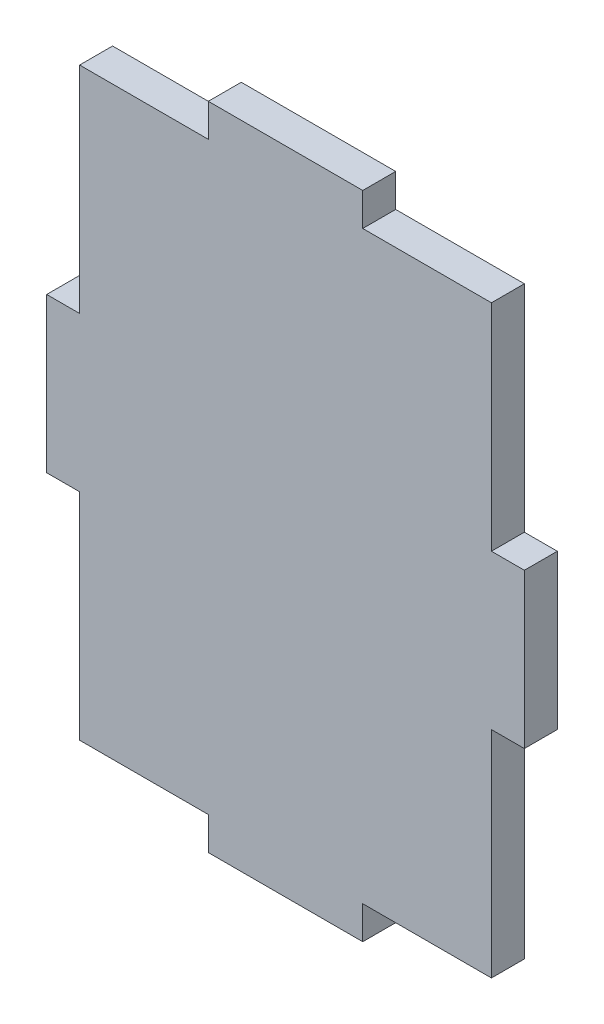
from build123d import *

# Parameters (mm, degrees)
BOSS_EXTRUDE1_DEPTH = 16


with BuildPart() as part:
    # Sketch1 → Boss-Extrude1 (new body)
    with BuildSketch(Plane.XY):
        Polygon((0, 0), (62.5, 0), (62.5, -16), (137.5, -16), (137.5, 0), (200, 0), (200, 104.5), (216, 104.5), (216, 179.5), (200, 179.5), (200, 284), (137.5, 284), (137.5, 300), (62.5, 300), (62.5, 284), (0, 284), (0, 179.5), (-16, 179.5), (-16, 104.5), (0, 104.5), align=None)
    extrude(amount=BOSS_EXTRUDE1_DEPTH)


solid = part.part
